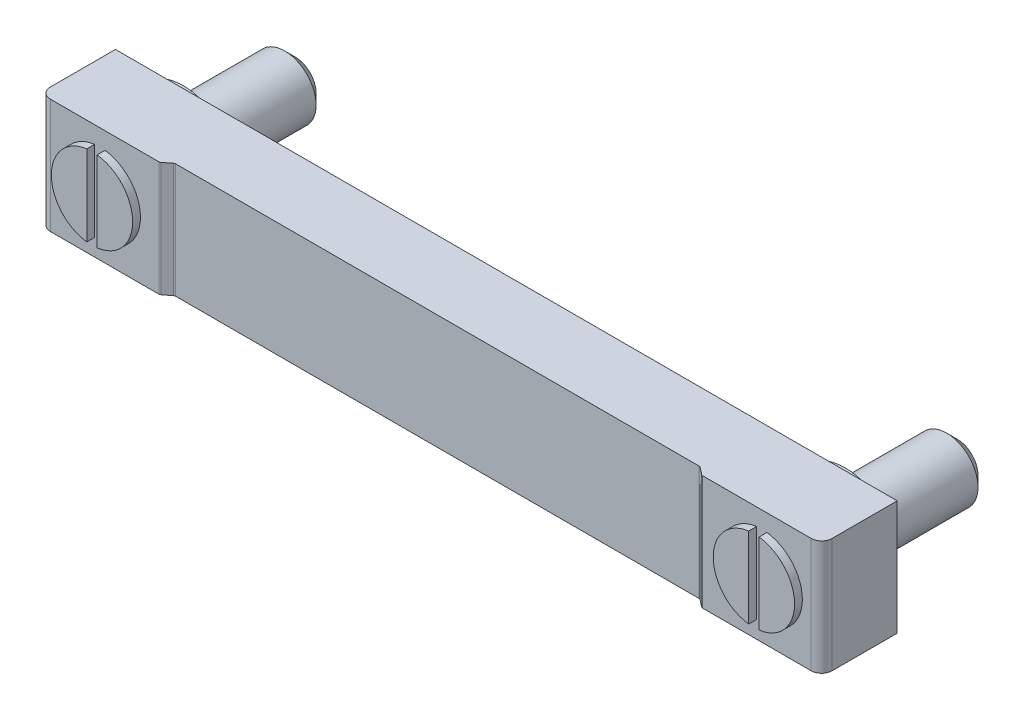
ISO-10303-21;
HEADER;
FILE_DESCRIPTION(('STEP AP214'),'2;1');
FILE_NAME('part.step','',(''),(''),'','','');
FILE_SCHEMA(('AUTOMOTIVE_DESIGN { 1 0 10303 214 1 1 1 1 }'));
ENDSEC;
DATA;
#1=APPLICATION_CONTEXT('core data for automotive mechanical design processes');
#2=APPLICATION_PROTOCOL_DEFINITION('international standard','automotive_design',2000,#1);
#3=PRODUCT_CONTEXT('',#1,'mechanical');
#4=PRODUCT('Part','Part','',(#3));
#5=PRODUCT_RELATED_PRODUCT_CATEGORY('part','',(#4));
#6=PRODUCT_DEFINITION_FORMATION('','',#4);
#7=PRODUCT_DEFINITION_CONTEXT('part definition',#1,'design');
#8=PRODUCT_DEFINITION('design','',#6,#7);
#9=PRODUCT_DEFINITION_SHAPE('','',#8);
#10=(LENGTH_UNIT() NAMED_UNIT(*) SI_UNIT(.MILLI.,.METRE.));
#11=(NAMED_UNIT(*) PLANE_ANGLE_UNIT() SI_UNIT($,.RADIAN.));
#12=(NAMED_UNIT(*) SI_UNIT($,.STERADIAN.) SOLID_ANGLE_UNIT());
#13=UNCERTAINTY_MEASURE_WITH_UNIT(LENGTH_MEASURE(1.E-05),#10,'distance_accuracy_value','');
#14=(GEOMETRIC_REPRESENTATION_CONTEXT(3) GLOBAL_UNCERTAINTY_ASSIGNED_CONTEXT((#13)) GLOBAL_UNIT_ASSIGNED_CONTEXT((#10,
#11,#12)) REPRESENTATION_CONTEXT('',''));
#15=CARTESIAN_POINT('',(0.,0.,0.));
#16=DIRECTION('',(0.,0.,1.));
#17=DIRECTION('',(1.,0.,0.));
#18=AXIS2_PLACEMENT_3D('',#15,#16,#17);
#19=CARTESIAN_POINT('',(10.,-11.,0.));
#20=DIRECTION('',(0.,0.,1.));
#21=DIRECTION('',(0.,1.,0.));
#22=AXIS2_PLACEMENT_3D('',#19,#20,#21);
#23=PLANE('',#22);
#24=CARTESIAN_POINT('',(127.,0.,0.));
#25=DIRECTION('',(0.,0.,1.));
#26=DIRECTION('',(0.,1.,0.));
#27=AXIS2_PLACEMENT_3D('',#24,#25,#26);
#28=CIRCLE('',#27,10.);
#29=CARTESIAN_POINT('',(127.,10.,0.));
#30=VERTEX_POINT('',#29);
#31=EDGE_CURVE('E197',#30,#30,#28,.T.);
#32=ORIENTED_EDGE('',*,*,#31,.F.);
#33=EDGE_LOOP('',(#32));
#34=FACE_BOUND('',#33,.T.);
#35=CARTESIAN_POINT('',(127.,0.,0.));
#36=DIRECTION('',(0.,0.,1.));
#37=DIRECTION('',(0.,1.,0.));
#38=AXIS2_PLACEMENT_3D('',#35,#36,#37);
#39=CIRCLE('',#38,6.);
#40=CARTESIAN_POINT('',(127.,6.,0.));
#41=VERTEX_POINT('',#40);
#42=EDGE_CURVE('E354',#41,#41,#39,.F.);
#43=ORIENTED_EDGE('',*,*,#42,.F.);
#44=EDGE_LOOP('',(#43));
#45=FACE_BOUND('',#44,.T.);
#46=ADVANCED_FACE('F14',(#34,#45),#23,.F.);
#47=CARTESIAN_POINT('',(115.671924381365,-11.,15.9974236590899));
#48=DIRECTION('',(0.,0.,-1.));
#49=DIRECTION('',(0.,-1.,0.));
#50=AXIS2_PLACEMENT_3D('',#47,#48,#49);
#51=PLANE('',#50);
#52=CARTESIAN_POINT('',(127.,0.,15.9974236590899));
#53=DIRECTION('',(0.,0.,1.));
#54=DIRECTION('',(0.,1.,0.));
#55=AXIS2_PLACEMENT_3D('',#52,#53,#54);
#56=CIRCLE('',#55,7.8);
#57=CARTESIAN_POINT('',(126.,7.73563184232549,15.9974236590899));
#58=VERTEX_POINT('',#57);
#59=CARTESIAN_POINT('',(126.,-7.73563184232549,15.9974236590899));
#60=VERTEX_POINT('',#59);
#61=EDGE_CURVE('E179',#58,#60,#56,.T.);
#62=ORIENTED_EDGE('',*,*,#61,.F.);
#63=DIRECTION('',(0.,1.,0.));
#64=VECTOR('',#63,1.);
#65=CARTESIAN_POINT('',(126.,-7.73563184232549,15.9974236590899));
#66=LINE('',#65,#64);
#67=EDGE_CURVE('E35',#60,#58,#66,.T.);
#68=ORIENTED_EDGE('',*,*,#67,.F.);
#69=EDGE_LOOP('',(#62,#68));
#70=FACE_BOUND('',#69,.T.);
#71=DIRECTION('',(-1.,0.,0.));
#72=VECTOR('',#71,1.);
#73=CARTESIAN_POINT('',(115.671924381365,11.,15.9974236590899));
#74=LINE('',#73,#72);
#75=CARTESIAN_POINT('',(136.5,11.,15.9974236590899));
#76=VERTEX_POINT('',#75);
#77=CARTESIAN_POINT('',(115.671924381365,11.,15.9974236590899));
#78=VERTEX_POINT('',#77);
#79=EDGE_CURVE('E253',#76,#78,#74,.T.);
#80=ORIENTED_EDGE('',*,*,#79,.T.);
#81=DIRECTION('',(0.,1.,0.));
#82=VECTOR('',#81,1.);
#83=CARTESIAN_POINT('',(115.671924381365,-11.,15.9974236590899));
#84=LINE('',#83,#82);
#85=CARTESIAN_POINT('',(115.671924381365,-11.,15.9974236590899));
#86=VERTEX_POINT('',#85);
#87=EDGE_CURVE('E324',#86,#78,#84,.T.);
#88=ORIENTED_EDGE('',*,*,#87,.F.);
#89=DIRECTION('',(-1.,0.,0.));
#90=VECTOR('',#89,1.);
#91=CARTESIAN_POINT('',(136.5,-11.,15.9974236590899));
#92=LINE('',#91,#90);
#93=CARTESIAN_POINT('',(136.5,-11.,15.9974236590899));
#94=VERTEX_POINT('',#93);
#95=EDGE_CURVE('E282',#94,#86,#92,.T.);
#96=ORIENTED_EDGE('',*,*,#95,.F.);
#97=DIRECTION('',(0.,1.,0.));
#98=VECTOR('',#97,1.);
#99=CARTESIAN_POINT('',(136.5,-11.,15.9974236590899));
#100=LINE('',#99,#98);
#101=EDGE_CURVE('E327',#94,#76,#100,.T.);
#102=ORIENTED_EDGE('',*,*,#101,.T.);
#103=EDGE_LOOP('',(#80,#88,#96,#102));
#104=FACE_BOUND('',#103,.T.);
#105=CARTESIAN_POINT('',(127.,0.,15.9974236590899));
#106=DIRECTION('',(0.,0.,1.));
#107=DIRECTION('',(0.,1.,0.));
#108=AXIS2_PLACEMENT_3D('',#105,#106,#107);
#109=CIRCLE('',#108,7.8);
#110=CARTESIAN_POINT('',(128.,-7.73563184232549,15.9974236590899));
#111=VERTEX_POINT('',#110);
#112=CARTESIAN_POINT('',(128.,7.73563184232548,15.9974236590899));
#113=VERTEX_POINT('',#112);
#114=EDGE_CURVE('E161',#111,#113,#109,.T.);
#115=ORIENTED_EDGE('',*,*,#114,.F.);
#116=DIRECTION('',(0.,-1.,0.));
#117=VECTOR('',#116,1.);
#118=CARTESIAN_POINT('',(128.,-7.73563184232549,15.9974236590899));
#119=LINE('',#118,#117);
#120=EDGE_CURVE('E28',#113,#111,#119,.T.);
#121=ORIENTED_EDGE('',*,*,#120,.F.);
#122=EDGE_LOOP('',(#115,#121));
#123=FACE_BOUND('',#122,.T.);
#124=ADVANCED_FACE('F162',(#70,#104,#123),#51,.F.);
#125=CARTESIAN_POINT('',(10.,-11.,0.));
#126=DIRECTION('',(0.,0.,1.));
#127=DIRECTION('',(0.,1.,0.));
#128=AXIS2_PLACEMENT_3D('',#125,#126,#127);
#129=PLANE('',#128);
#130=CARTESIAN_POINT('',(0.,0.,0.));
#131=DIRECTION('',(0.,0.,-1.));
#132=DIRECTION('',(0.,-1.,0.));
#133=AXIS2_PLACEMENT_3D('',#130,#131,#132);
#134=CIRCLE('',#133,10.);
#135=CARTESIAN_POINT('',(0.,-10.,0.));
#136=VERTEX_POINT('',#135);
#137=EDGE_CURVE('E200',#136,#136,#134,.T.);
#138=ORIENTED_EDGE('',*,*,#137,.T.);
#139=EDGE_LOOP('',(#138));
#140=FACE_BOUND('',#139,.T.);
#141=CARTESIAN_POINT('',(0.,0.,0.));
#142=DIRECTION('',(0.,0.,1.));
#143=DIRECTION('',(0.,1.,0.));
#144=AXIS2_PLACEMENT_3D('',#141,#142,#143);
#145=CIRCLE('',#144,6.);
#146=CARTESIAN_POINT('',(0.,6.,0.));
#147=VERTEX_POINT('',#146);
#148=EDGE_CURVE('E345',#147,#147,#145,.F.);
#149=ORIENTED_EDGE('',*,*,#148,.F.);
#150=EDGE_LOOP('',(#149));
#151=FACE_BOUND('',#150,.T.);
#152=ADVANCED_FACE('F380',(#140,#151),#129,.F.);
#153=CARTESIAN_POINT('',(137.,-11.,1.49742365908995));
#154=DIRECTION('',(0.,0.,1.));
#155=DIRECTION('',(0.,1.,0.));
#156=AXIS2_PLACEMENT_3D('',#153,#154,#155);
#157=PLANE('',#156);
#158=DIRECTION('',(1.,0.,0.));
#159=VECTOR('',#158,1.);
#160=CARTESIAN_POINT('',(137.,11.,1.49742365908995));
#161=LINE('',#160,#159);
#162=CARTESIAN_POINT('',(-11.5,11.,1.49742365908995));
#163=VERTEX_POINT('',#162);
#164=CARTESIAN_POINT('',(138.5,11.,1.49742365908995));
#165=VERTEX_POINT('',#164);
#166=EDGE_CURVE('E246',#163,#165,#161,.T.);
#167=ORIENTED_EDGE('',*,*,#166,.T.);
#168=DIRECTION('',(0.,1.,0.));
#169=VECTOR('',#168,1.);
#170=CARTESIAN_POINT('',(138.5,-11.,1.49742365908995));
#171=LINE('',#170,#169);
#172=CARTESIAN_POINT('',(138.5,-11.,1.49742365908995));
#173=VERTEX_POINT('',#172);
#174=EDGE_CURVE('E333',#173,#165,#171,.T.);
#175=ORIENTED_EDGE('',*,*,#174,.F.);
#176=DIRECTION('',(1.,0.,0.));
#177=VECTOR('',#176,1.);
#178=CARTESIAN_POINT('',(-11.5,-11.,1.49742365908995));
#179=LINE('',#178,#177);
#180=CARTESIAN_POINT('',(-11.5,-11.,1.49742365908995));
#181=VERTEX_POINT('',#180);
#182=EDGE_CURVE('E276',#181,#173,#179,.T.);
#183=ORIENTED_EDGE('',*,*,#182,.F.);
#184=DIRECTION('',(0.,1.,0.));
#185=VECTOR('',#184,1.);
#186=CARTESIAN_POINT('',(-11.5,-11.,1.49742365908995));
#187=LINE('',#186,#185);
#188=EDGE_CURVE('E336',#181,#163,#187,.T.);
#189=ORIENTED_EDGE('',*,*,#188,.T.);
#190=EDGE_LOOP('',(#167,#175,#183,#189));
#191=FACE_BOUND('',#190,.T.);
#192=CARTESIAN_POINT('',(0.,0.,1.49742365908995));
#193=DIRECTION('',(0.,0.,1.));
#194=DIRECTION('',(0.,1.,0.));
#195=AXIS2_PLACEMENT_3D('',#192,#193,#194);
#196=CIRCLE('',#195,10.);
#197=CARTESIAN_POINT('',(0.,10.,1.49742365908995));
#198=VERTEX_POINT('',#197);
#199=EDGE_CURVE('E203',#198,#198,#196,.F.);
#200=ORIENTED_EDGE('',*,*,#199,.F.);
#201=EDGE_LOOP('',(#200));
#202=FACE_BOUND('',#201,.T.);
#203=CARTESIAN_POINT('',(127.,0.,1.49742365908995));
#204=DIRECTION('',(0.,0.,1.));
#205=DIRECTION('',(0.,1.,0.));
#206=AXIS2_PLACEMENT_3D('',#203,#204,#205);
#207=CIRCLE('',#206,10.);
#208=CARTESIAN_POINT('',(127.,10.,1.49742365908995));
#209=VERTEX_POINT('',#208);
#210=EDGE_CURVE('E342',#209,#209,#207,.F.);
#211=ORIENTED_EDGE('',*,*,#210,.F.);
#212=EDGE_LOOP('',(#211));
#213=FACE_BOUND('',#212,.T.);
#214=ADVANCED_FACE('F432',(#191,#202,#213),#157,.F.);
#215=CARTESIAN_POINT('',(11.3280756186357,-11.,15.9974236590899));
#216=DIRECTION('',(0.,0.,-1.));
#217=DIRECTION('',(0.,-1.,0.));
#218=AXIS2_PLACEMENT_3D('',#215,#216,#217);
#219=PLANE('',#218);
#220=CARTESIAN_POINT('',(0.,0.,15.9974236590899));
#221=DIRECTION('',(0.,0.,1.));
#222=DIRECTION('',(0.,1.,0.));
#223=AXIS2_PLACEMENT_3D('',#220,#221,#222);
#224=CIRCLE('',#223,7.8);
#225=CARTESIAN_POINT('',(-1.,7.73563184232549,15.9974236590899));
#226=VERTEX_POINT('',#225);
#227=CARTESIAN_POINT('',(-1.,-7.73563184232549,15.9974236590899));
#228=VERTEX_POINT('',#227);
#229=EDGE_CURVE('E223',#226,#228,#224,.T.);
#230=ORIENTED_EDGE('',*,*,#229,.F.);
#231=DIRECTION('',(0.,1.,0.));
#232=VECTOR('',#231,1.);
#233=CARTESIAN_POINT('',(-1.,-7.73563184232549,15.9974236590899));
#234=LINE('',#233,#232);
#235=EDGE_CURVE('E226',#228,#226,#234,.T.);
#236=ORIENTED_EDGE('',*,*,#235,.F.);
#237=EDGE_LOOP('',(#230,#236));
#238=FACE_BOUND('',#237,.T.);
#239=DIRECTION('',(-1.,0.,0.));
#240=VECTOR('',#239,1.);
#241=CARTESIAN_POINT('',(11.3280756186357,11.,15.9974236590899));
#242=LINE('',#241,#240);
#243=CARTESIAN_POINT('',(11.3280756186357,11.,15.9974236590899));
#244=VERTEX_POINT('',#243);
#245=CARTESIAN_POINT('',(-9.5,11.,15.9974236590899));
#246=VERTEX_POINT('',#245);
#247=EDGE_CURVE('E269',#244,#246,#242,.T.);
#248=ORIENTED_EDGE('',*,*,#247,.T.);
#249=DIRECTION('',(0.,1.,0.));
#250=VECTOR('',#249,1.);
#251=CARTESIAN_POINT('',(-9.5,-11.,15.9974236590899));
#252=LINE('',#251,#250);
#253=CARTESIAN_POINT('',(-9.5,-11.,15.9974236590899));
#254=VERTEX_POINT('',#253);
#255=EDGE_CURVE('E300',#254,#246,#252,.T.);
#256=ORIENTED_EDGE('',*,*,#255,.F.);
#257=DIRECTION('',(-1.,0.,0.));
#258=VECTOR('',#257,1.);
#259=CARTESIAN_POINT('',(11.3280756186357,-11.,15.9974236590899));
#260=LINE('',#259,#258);
#261=CARTESIAN_POINT('',(11.3280756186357,-11.,15.9974236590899));
#262=VERTEX_POINT('',#261);
#263=EDGE_CURVE('E298',#262,#254,#260,.T.);
#264=ORIENTED_EDGE('',*,*,#263,.F.);
#265=DIRECTION('',(0.,1.,0.));
#266=VECTOR('',#265,1.);
#267=CARTESIAN_POINT('',(11.3280756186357,-11.,15.9974236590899));
#268=LINE('',#267,#266);
#269=EDGE_CURVE('E303',#262,#244,#268,.T.);
#270=ORIENTED_EDGE('',*,*,#269,.T.);
#271=EDGE_LOOP('',(#248,#256,#264,#270));
#272=FACE_BOUND('',#271,.T.);
#273=CARTESIAN_POINT('',(0.,0.,15.9974236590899));
#274=DIRECTION('',(0.,0.,1.));
#275=DIRECTION('',(0.,1.,0.));
#276=AXIS2_PLACEMENT_3D('',#273,#274,#275);
#277=CIRCLE('',#276,7.8);
#278=CARTESIAN_POINT('',(1.,-7.73563184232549,15.9974236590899));
#279=VERTEX_POINT('',#278);
#280=CARTESIAN_POINT('',(1.,7.73563184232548,15.9974236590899));
#281=VERTEX_POINT('',#280);
#282=EDGE_CURVE('E206',#279,#281,#277,.T.);
#283=ORIENTED_EDGE('',*,*,#282,.F.);
#284=DIRECTION('',(0.,-1.,0.));
#285=VECTOR('',#284,1.);
#286=CARTESIAN_POINT('',(1.,-7.73563184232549,15.9974236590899));
#287=LINE('',#286,#285);
#288=EDGE_CURVE('E209',#281,#279,#287,.T.);
#289=ORIENTED_EDGE('',*,*,#288,.F.);
#290=EDGE_LOOP('',(#283,#289));
#291=FACE_BOUND('',#290,.T.);
#292=ADVANCED_FACE('F429',(#238,#272,#291),#219,.F.);
#293=CARTESIAN_POINT('',(-9.5,-11.,13.9974236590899));
#294=DIRECTION('',(0.,1.,0.));
#295=DIRECTION('',(0.,0.,-1.));
#296=AXIS2_PLACEMENT_3D('',#293,#294,#295);
#297=CYLINDRICAL_SURFACE('',#296,2.);
#298=CARTESIAN_POINT('',(-9.5,11.,13.9974236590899));
#299=DIRECTION('',(0.,-1.,0.));
#300=DIRECTION('',(0.,0.,-1.));
#301=AXIS2_PLACEMENT_3D('',#298,#299,#300);
#302=CIRCLE('',#301,2.);
#303=CARTESIAN_POINT('',(-11.5,11.,13.9974236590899));
#304=VERTEX_POINT('',#303);
#305=EDGE_CURVE('E240',#246,#304,#302,.T.);
#306=ORIENTED_EDGE('',*,*,#305,.T.);
#307=DIRECTION('',(0.,1.,0.));
#308=VECTOR('',#307,1.);
#309=CARTESIAN_POINT('',(-11.5,-11.,13.9974236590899));
#310=LINE('',#309,#308);
#311=CARTESIAN_POINT('',(-11.5,-11.,13.9974236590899));
#312=VERTEX_POINT('',#311);
#313=EDGE_CURVE('E339',#312,#304,#310,.T.);
#314=ORIENTED_EDGE('',*,*,#313,.F.);
#315=CARTESIAN_POINT('',(-9.5,-11.,13.9974236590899));
#316=DIRECTION('',(0.,-1.,0.));
#317=DIRECTION('',(0.,0.,-1.));
#318=AXIS2_PLACEMENT_3D('',#315,#316,#317);
#319=CIRCLE('',#318,2.);
#320=EDGE_CURVE('E271',#254,#312,#319,.T.);
#321=ORIENTED_EDGE('',*,*,#320,.F.);
#322=ORIENTED_EDGE('',*,*,#255,.T.);
#323=EDGE_LOOP('',(#306,#314,#321,#322));
#324=FACE_BOUND('',#323,.T.);
#325=ADVANCED_FACE('F16',(#324),#297,.T.);
#326=CARTESIAN_POINT('',(-11.5,-11.,1.49742365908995));
#327=DIRECTION('',(1.,0.,0.));
#328=DIRECTION('',(0.,1.,0.));
#329=AXIS2_PLACEMENT_3D('',#326,#327,#328);
#330=PLANE('',#329);
#331=DIRECTION('',(0.,0.,-1.));
#332=VECTOR('',#331,1.);
#333=CARTESIAN_POINT('',(-11.5,11.,1.49742365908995));
#334=LINE('',#333,#332);
#335=EDGE_CURVE('E243',#304,#163,#334,.T.);
#336=ORIENTED_EDGE('',*,*,#335,.T.);
#337=ORIENTED_EDGE('',*,*,#188,.F.);
#338=DIRECTION('',(0.,0.,-1.));
#339=VECTOR('',#338,1.);
#340=CARTESIAN_POINT('',(-11.5,-11.,1.49742365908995));
#341=LINE('',#340,#339);
#342=EDGE_CURVE('E274',#312,#181,#341,.T.);
#343=ORIENTED_EDGE('',*,*,#342,.F.);
#344=ORIENTED_EDGE('',*,*,#313,.T.);
#345=EDGE_LOOP('',(#336,#337,#343,#344));
#346=FACE_BOUND('',#345,.T.);
#347=ADVANCED_FACE('F468',(#346),#330,.F.);
#348=CARTESIAN_POINT('',(138.5,-11.,1.49742365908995));
#349=DIRECTION('',(-1.,0.,0.));
#350=DIRECTION('',(0.,-1.,0.));
#351=AXIS2_PLACEMENT_3D('',#348,#349,#350);
#352=PLANE('',#351);
#353=DIRECTION('',(0.,0.,1.));
#354=VECTOR('',#353,1.);
#355=CARTESIAN_POINT('',(138.5,11.,1.49742365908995));
#356=LINE('',#355,#354);
#357=CARTESIAN_POINT('',(138.5,11.,13.9974236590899));
#358=VERTEX_POINT('',#357);
#359=EDGE_CURVE('E248',#165,#358,#356,.T.);
#360=ORIENTED_EDGE('',*,*,#359,.T.);
#361=DIRECTION('',(0.,1.,0.));
#362=VECTOR('',#361,1.);
#363=CARTESIAN_POINT('',(138.5,-11.,13.9974236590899));
#364=LINE('',#363,#362);
#365=CARTESIAN_POINT('',(138.5,-11.,13.9974236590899));
#366=VERTEX_POINT('',#365);
#367=EDGE_CURVE('E330',#366,#358,#364,.T.);
#368=ORIENTED_EDGE('',*,*,#367,.F.);
#369=DIRECTION('',(0.,0.,1.));
#370=VECTOR('',#369,1.);
#371=CARTESIAN_POINT('',(138.5,-11.,1.49742365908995));
#372=LINE('',#371,#370);
#373=EDGE_CURVE('E278',#173,#366,#372,.T.);
#374=ORIENTED_EDGE('',*,*,#373,.F.);
#375=ORIENTED_EDGE('',*,*,#174,.T.);
#376=EDGE_LOOP('',(#360,#368,#374,#375));
#377=FACE_BOUND('',#376,.T.);
#378=ADVANCED_FACE('F464',(#377),#352,.F.);
#379=CARTESIAN_POINT('',(136.5,-11.,13.9974236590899));
#380=DIRECTION('',(0.,1.,0.));
#381=DIRECTION('',(0.,0.,-1.));
#382=AXIS2_PLACEMENT_3D('',#379,#380,#381);
#383=CYLINDRICAL_SURFACE('',#382,2.);
#384=CARTESIAN_POINT('',(136.5,11.,13.9974236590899));
#385=DIRECTION('',(0.,-1.,0.));
#386=DIRECTION('',(0.,0.,-1.));
#387=AXIS2_PLACEMENT_3D('',#384,#385,#386);
#388=CIRCLE('',#387,2.);
#389=EDGE_CURVE('E250',#358,#76,#388,.T.);
#390=ORIENTED_EDGE('',*,*,#389,.T.);
#391=ORIENTED_EDGE('',*,*,#101,.F.);
#392=CARTESIAN_POINT('',(136.5,-11.,13.9974236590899));
#393=DIRECTION('',(0.,-1.,0.));
#394=DIRECTION('',(0.,0.,-1.));
#395=AXIS2_PLACEMENT_3D('',#392,#393,#394);
#396=CIRCLE('',#395,2.);
#397=EDGE_CURVE('E280',#366,#94,#396,.T.);
#398=ORIENTED_EDGE('',*,*,#397,.F.);
#399=ORIENTED_EDGE('',*,*,#367,.T.);
#400=EDGE_LOOP('',(#390,#391,#398,#399));
#401=FACE_BOUND('',#400,.T.);
#402=ADVANCED_FACE('F459',(#401),#383,.T.);
#403=CARTESIAN_POINT('',(115.671924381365,-11.,15.4974236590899));
#404=DIRECTION('',(0.,1.,0.));
#405=DIRECTION('',(0.,0.,-1.));
#406=AXIS2_PLACEMENT_3D('',#403,#404,#405);
#407=CYLINDRICAL_SURFACE('',#406,0.499999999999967);
#408=CARTESIAN_POINT('',(115.671924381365,11.,15.4974236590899));
#409=DIRECTION('',(0.,-1.,0.));
#410=DIRECTION('',(0.,0.,-1.));
#411=AXIS2_PLACEMENT_3D('',#408,#409,#410);
#412=CIRCLE('',#411,0.499999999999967);
#413=CARTESIAN_POINT('',(115.364431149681,11.,15.891692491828));
#414=VERTEX_POINT('',#413);
#415=EDGE_CURVE('E255',#78,#414,#412,.T.);
#416=ORIENTED_EDGE('',*,*,#415,.T.);
#417=DIRECTION('',(0.,1.,0.));
#418=VECTOR('',#417,1.);
#419=CARTESIAN_POINT('',(115.364431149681,-11.,15.891692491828));
#420=LINE('',#419,#418);
#421=CARTESIAN_POINT('',(115.364431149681,-11.,15.891692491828));
#422=VERTEX_POINT('',#421);
#423=EDGE_CURVE('E321',#422,#414,#420,.T.);
#424=ORIENTED_EDGE('',*,*,#423,.F.);
#425=CARTESIAN_POINT('',(115.671924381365,-11.,15.4974236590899));
#426=DIRECTION('',(0.,-1.,0.));
#427=DIRECTION('',(0.,0.,-1.));
#428=AXIS2_PLACEMENT_3D('',#425,#426,#427);
#429=CIRCLE('',#428,0.499999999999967);
#430=EDGE_CURVE('E284',#86,#422,#429,.T.);
#431=ORIENTED_EDGE('',*,*,#430,.F.);
#432=ORIENTED_EDGE('',*,*,#87,.T.);
#433=EDGE_LOOP('',(#416,#424,#431,#432));
#434=FACE_BOUND('',#433,.T.);
#435=ADVANCED_FACE('F456',(#434),#407,.T.);
#436=CARTESIAN_POINT('',(115.364431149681,-11.,15.891692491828));
#437=DIRECTION('',(0.61498646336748,0.,-0.788537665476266));
#438=DIRECTION('',(0.788537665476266,0.,0.61498646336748));
#439=AXIS2_PLACEMENT_3D('',#436,#437,#438);
#440=PLANE('',#439);
#441=DIRECTION('',(-0.788537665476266,0.,-0.61498646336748));
#442=VECTOR('',#441,1.);
#443=CARTESIAN_POINT('',(115.364431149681,11.,15.891692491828));
#444=LINE('',#443,#442);
#445=CARTESIAN_POINT('',(114.012389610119,11.,14.83722511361));
#446=VERTEX_POINT('',#445);
#447=EDGE_CURVE('E257',#414,#446,#444,.T.);
#448=ORIENTED_EDGE('',*,*,#447,.T.);
#449=DIRECTION('',(0.,1.,0.));
#450=VECTOR('',#449,1.);
#451=CARTESIAN_POINT('',(114.012389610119,-11.,14.83722511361));
#452=LINE('',#451,#450);
#453=CARTESIAN_POINT('',(114.012389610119,-11.,14.83722511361));
#454=VERTEX_POINT('',#453);
#455=EDGE_CURVE('E318',#454,#446,#452,.T.);
#456=ORIENTED_EDGE('',*,*,#455,.F.);
#457=DIRECTION('',(-0.788537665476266,0.,-0.61498646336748));
#458=VECTOR('',#457,1.);
#459=CARTESIAN_POINT('',(115.364431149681,-11.,15.891692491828));
#460=LINE('',#459,#458);
#461=EDGE_CURVE('E286',#422,#454,#460,.T.);
#462=ORIENTED_EDGE('',*,*,#461,.F.);
#463=ORIENTED_EDGE('',*,*,#423,.T.);
#464=EDGE_LOOP('',(#448,#456,#462,#463));
#465=FACE_BOUND('',#464,.T.);
#466=ADVANCED_FACE('F452',(#465),#440,.F.);
#467=CARTESIAN_POINT('',(113.704896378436,-11.,15.2314939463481));
#468=DIRECTION('',(0.,1.,0.));
#469=DIRECTION('',(0.,0.,-1.));
#470=AXIS2_PLACEMENT_3D('',#467,#468,#469);
#471=CYLINDRICAL_SURFACE('',#470,0.50000000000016);
#472=CARTESIAN_POINT('',(113.704896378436,11.,15.2314939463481));
#473=DIRECTION('',(0.,1.,0.));
#474=DIRECTION('',(0.,0.,-1.));
#475=AXIS2_PLACEMENT_3D('',#472,#473,#474);
#476=CIRCLE('',#475,0.50000000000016);
#477=CARTESIAN_POINT('',(113.704896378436,11.,14.7314939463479));
#478=VERTEX_POINT('',#477);
#479=EDGE_CURVE('E259',#446,#478,#476,.T.);
#480=ORIENTED_EDGE('',*,*,#479,.T.);
#481=DIRECTION('',(0.,1.,0.));
#482=VECTOR('',#481,1.);
#483=CARTESIAN_POINT('',(113.704896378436,-11.,14.7314939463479));
#484=LINE('',#483,#482);
#485=CARTESIAN_POINT('',(113.704896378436,-11.,14.7314939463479));
#486=VERTEX_POINT('',#485);
#487=EDGE_CURVE('E315',#486,#478,#484,.T.);
#488=ORIENTED_EDGE('',*,*,#487,.F.);
#489=CARTESIAN_POINT('',(113.704896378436,-11.,15.2314939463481));
#490=DIRECTION('',(0.,1.,0.));
#491=DIRECTION('',(0.,0.,-1.));
#492=AXIS2_PLACEMENT_3D('',#489,#490,#491);
#493=CIRCLE('',#492,0.50000000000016);
#494=EDGE_CURVE('E288',#454,#486,#493,.T.);
#495=ORIENTED_EDGE('',*,*,#494,.F.);
#496=ORIENTED_EDGE('',*,*,#455,.T.);
#497=EDGE_LOOP('',(#480,#488,#495,#496));
#498=FACE_BOUND('',#497,.T.);
#499=ADVANCED_FACE('F448',(#498),#471,.F.);
#500=CARTESIAN_POINT('',(113.704896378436,-11.,14.7314939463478));
#501=DIRECTION('',(0.,0.,-1.));
#502=DIRECTION('',(1.,0.,0.));
#503=AXIS2_PLACEMENT_3D('',#500,#501,#502);
#504=PLANE('',#503);
#505=DIRECTION('',(-1.,0.,0.));
#506=VECTOR('',#505,1.);
#507=CARTESIAN_POINT('',(113.704896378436,11.,14.7314939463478));
#508=LINE('',#507,#506);
#509=CARTESIAN_POINT('',(13.2951036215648,11.,14.7314939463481));
#510=VERTEX_POINT('',#509);
#511=EDGE_CURVE('E261',#478,#510,#508,.T.);
#512=ORIENTED_EDGE('',*,*,#511,.T.);
#513=DIRECTION('',(0.,1.,0.));
#514=VECTOR('',#513,1.);
#515=CARTESIAN_POINT('',(13.2951036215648,-11.,14.7314939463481));
#516=LINE('',#515,#514);
#517=CARTESIAN_POINT('',(13.2951036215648,-11.,14.7314939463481));
#518=VERTEX_POINT('',#517);
#519=EDGE_CURVE('E312',#518,#510,#516,.T.);
#520=ORIENTED_EDGE('',*,*,#519,.F.);
#521=DIRECTION('',(-1.,0.,0.));
#522=VECTOR('',#521,1.);
#523=CARTESIAN_POINT('',(113.704896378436,-11.,14.7314939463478));
#524=LINE('',#523,#522);
#525=EDGE_CURVE('E290',#486,#518,#524,.T.);
#526=ORIENTED_EDGE('',*,*,#525,.F.);
#527=ORIENTED_EDGE('',*,*,#487,.T.);
#528=EDGE_LOOP('',(#512,#520,#526,#527));
#529=FACE_BOUND('',#528,.T.);
#530=ADVANCED_FACE('F444',(#529),#504,.F.);
#531=CARTESIAN_POINT('',(13.2951036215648,-11.,15.2314939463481));
#532=DIRECTION('',(0.,1.,0.));
#533=DIRECTION('',(0.,0.,-1.));
#534=AXIS2_PLACEMENT_3D('',#531,#532,#533);
#535=CYLINDRICAL_SURFACE('',#534,0.500000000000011);
#536=CARTESIAN_POINT('',(13.2951036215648,11.,15.2314939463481));
#537=DIRECTION('',(0.,1.,0.));
#538=DIRECTION('',(0.,0.,-1.));
#539=AXIS2_PLACEMENT_3D('',#536,#537,#538);
#540=CIRCLE('',#539,0.500000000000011);
#541=CARTESIAN_POINT('',(12.987610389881,11.,14.83722511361));
#542=VERTEX_POINT('',#541);
#543=EDGE_CURVE('E263',#510,#542,#540,.T.);
#544=ORIENTED_EDGE('',*,*,#543,.T.);
#545=DIRECTION('',(0.,1.,0.));
#546=VECTOR('',#545,1.);
#547=CARTESIAN_POINT('',(12.987610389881,-11.,14.83722511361));
#548=LINE('',#547,#546);
#549=CARTESIAN_POINT('',(12.987610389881,-11.,14.83722511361));
#550=VERTEX_POINT('',#549);
#551=EDGE_CURVE('E309',#550,#542,#548,.T.);
#552=ORIENTED_EDGE('',*,*,#551,.F.);
#553=CARTESIAN_POINT('',(13.2951036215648,-11.,15.2314939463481));
#554=DIRECTION('',(0.,1.,0.));
#555=DIRECTION('',(0.,0.,-1.));
#556=AXIS2_PLACEMENT_3D('',#553,#554,#555);
#557=CIRCLE('',#556,0.500000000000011);
#558=EDGE_CURVE('E292',#518,#550,#557,.T.);
#559=ORIENTED_EDGE('',*,*,#558,.F.);
#560=ORIENTED_EDGE('',*,*,#519,.T.);
#561=EDGE_LOOP('',(#544,#552,#559,#560));
#562=FACE_BOUND('',#561,.T.);
#563=ADVANCED_FACE('F440',(#562),#535,.F.);
#564=CARTESIAN_POINT('',(11.6355688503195,-11.,15.891692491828));
#565=DIRECTION('',(-0.614986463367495,0.,-0.788537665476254));
#566=DIRECTION('',(0.788537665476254,0.,-0.614986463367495));
#567=AXIS2_PLACEMENT_3D('',#564,#565,#566);
#568=PLANE('',#567);
#569=DIRECTION('',(-0.788537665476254,0.,0.614986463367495));
#570=VECTOR('',#569,1.);
#571=CARTESIAN_POINT('',(11.6355688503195,11.,15.891692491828));
#572=LINE('',#571,#570);
#573=CARTESIAN_POINT('',(11.6355688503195,11.,15.891692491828));
#574=VERTEX_POINT('',#573);
#575=EDGE_CURVE('E265',#542,#574,#572,.T.);
#576=ORIENTED_EDGE('',*,*,#575,.T.);
#577=DIRECTION('',(0.,1.,0.));
#578=VECTOR('',#577,1.);
#579=CARTESIAN_POINT('',(11.6355688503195,-11.,15.891692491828));
#580=LINE('',#579,#578);
#581=CARTESIAN_POINT('',(11.6355688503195,-11.,15.891692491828));
#582=VERTEX_POINT('',#581);
#583=EDGE_CURVE('E306',#582,#574,#580,.T.);
#584=ORIENTED_EDGE('',*,*,#583,.F.);
#585=DIRECTION('',(-0.788537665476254,0.,0.614986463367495));
#586=VECTOR('',#585,1.);
#587=CARTESIAN_POINT('',(11.6355688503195,-11.,15.891692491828));
#588=LINE('',#587,#586);
#589=EDGE_CURVE('E294',#550,#582,#588,.T.);
#590=ORIENTED_EDGE('',*,*,#589,.F.);
#591=ORIENTED_EDGE('',*,*,#551,.T.);
#592=EDGE_LOOP('',(#576,#584,#590,#591));
#593=FACE_BOUND('',#592,.T.);
#594=ADVANCED_FACE('F436',(#593),#568,.F.);
#595=CARTESIAN_POINT('',(11.3280756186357,-11.,15.4974236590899));
#596=DIRECTION('',(0.,1.,0.));
#597=DIRECTION('',(0.,0.,-1.));
#598=AXIS2_PLACEMENT_3D('',#595,#596,#597);
#599=CYLINDRICAL_SURFACE('',#598,0.499999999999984);
#600=CARTESIAN_POINT('',(11.3280756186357,11.,15.4974236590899));
#601=DIRECTION('',(0.,-1.,0.));
#602=DIRECTION('',(0.,0.,-1.));
#603=AXIS2_PLACEMENT_3D('',#600,#601,#602);
#604=CIRCLE('',#603,0.499999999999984);
#605=EDGE_CURVE('E267',#574,#244,#604,.T.);
#606=ORIENTED_EDGE('',*,*,#605,.T.);
#607=ORIENTED_EDGE('',*,*,#269,.F.);
#608=CARTESIAN_POINT('',(11.3280756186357,-11.,15.4974236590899));
#609=DIRECTION('',(0.,-1.,0.));
#610=DIRECTION('',(0.,0.,-1.));
#611=AXIS2_PLACEMENT_3D('',#608,#609,#610);
#612=CIRCLE('',#611,0.499999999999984);
#613=EDGE_CURVE('E296',#582,#262,#612,.T.);
#614=ORIENTED_EDGE('',*,*,#613,.F.);
#615=ORIENTED_EDGE('',*,*,#583,.T.);
#616=EDGE_LOOP('',(#606,#607,#614,#615));
#617=FACE_BOUND('',#616,.T.);
#618=ADVANCED_FACE('F427',(#617),#599,.T.);
#619=CARTESIAN_POINT('',(-9.5,-11.,13.9974236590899));
#620=DIRECTION('',(0.,1.,0.));
#621=DIRECTION('',(0.,0.,-1.));
#622=AXIS2_PLACEMENT_3D('',#619,#620,#621);
#623=PLANE('',#622);
#624=ORIENTED_EDGE('',*,*,#182,.T.);
#625=ORIENTED_EDGE('',*,*,#373,.T.);
#626=ORIENTED_EDGE('',*,*,#397,.T.);
#627=ORIENTED_EDGE('',*,*,#95,.T.);
#628=ORIENTED_EDGE('',*,*,#430,.T.);
#629=ORIENTED_EDGE('',*,*,#461,.T.);
#630=ORIENTED_EDGE('',*,*,#494,.T.);
#631=ORIENTED_EDGE('',*,*,#525,.T.);
#632=ORIENTED_EDGE('',*,*,#558,.T.);
#633=ORIENTED_EDGE('',*,*,#589,.T.);
#634=ORIENTED_EDGE('',*,*,#613,.T.);
#635=ORIENTED_EDGE('',*,*,#263,.T.);
#636=ORIENTED_EDGE('',*,*,#320,.T.);
#637=ORIENTED_EDGE('',*,*,#342,.T.);
#638=EDGE_LOOP('',(#624,#625,#626,#627,#628,#629,#630,#631,#632,#633,#634,#635,#636,#637));
#639=FACE_BOUND('',#638,.T.);
#640=ADVANCED_FACE('F423',(#639),#623,.F.);
#641=CARTESIAN_POINT('',(-9.5,11.,13.9974236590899));
#642=DIRECTION('',(0.,1.,0.));
#643=DIRECTION('',(0.,0.,-1.));
#644=AXIS2_PLACEMENT_3D('',#641,#642,#643);
#645=PLANE('',#644);
#646=ORIENTED_EDGE('',*,*,#166,.F.);
#647=ORIENTED_EDGE('',*,*,#335,.F.);
#648=ORIENTED_EDGE('',*,*,#305,.F.);
#649=ORIENTED_EDGE('',*,*,#247,.F.);
#650=ORIENTED_EDGE('',*,*,#605,.F.);
#651=ORIENTED_EDGE('',*,*,#575,.F.);
#652=ORIENTED_EDGE('',*,*,#543,.F.);
#653=ORIENTED_EDGE('',*,*,#511,.F.);
#654=ORIENTED_EDGE('',*,*,#479,.F.);
#655=ORIENTED_EDGE('',*,*,#447,.F.);
#656=ORIENTED_EDGE('',*,*,#415,.F.);
#657=ORIENTED_EDGE('',*,*,#79,.F.);
#658=ORIENTED_EDGE('',*,*,#389,.F.);
#659=ORIENTED_EDGE('',*,*,#359,.F.);
#660=EDGE_LOOP('',(#646,#647,#648,#649,#650,#651,#652,#653,#654,#655,#656,#657,#658,#659));
#661=FACE_BOUND('',#660,.T.);
#662=ADVANCED_FACE('F419',(#661),#645,.T.);
#663=CARTESIAN_POINT('',(0.,0.,17.4974236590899));
#664=DIRECTION('',(0.,0.,-1.));
#665=DIRECTION('',(0.,-1.,0.));
#666=AXIS2_PLACEMENT_3D('',#663,#664,#665);
#667=CYLINDRICAL_SURFACE('',#666,7.8);
#668=ORIENTED_EDGE('',*,*,#229,.T.);
#669=DIRECTION('',(0.,0.,-1.));
#670=VECTOR('',#669,1.);
#671=CARTESIAN_POINT('',(-1.,-7.73563184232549,17.4974236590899));
#672=LINE('',#671,#670);
#673=CARTESIAN_POINT('',(-1.,-7.73563184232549,17.4974236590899));
#674=VERTEX_POINT('',#673);
#675=EDGE_CURVE('E237',#674,#228,#672,.T.);
#676=ORIENTED_EDGE('',*,*,#675,.F.);
#677=CARTESIAN_POINT('',(0.,0.,17.4974236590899));
#678=DIRECTION('',(0.,0.,1.));
#679=DIRECTION('',(0.,1.,0.));
#680=AXIS2_PLACEMENT_3D('',#677,#678,#679);
#681=CIRCLE('',#680,7.8);
#682=CARTESIAN_POINT('',(-1.,7.73563184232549,17.4974236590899));
#683=VERTEX_POINT('',#682);
#684=EDGE_CURVE('E229',#683,#674,#681,.T.);
#685=ORIENTED_EDGE('',*,*,#684,.F.);
#686=DIRECTION('',(0.,0.,-1.));
#687=VECTOR('',#686,1.);
#688=CARTESIAN_POINT('',(-1.,7.73563184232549,17.4974236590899));
#689=LINE('',#688,#687);
#690=EDGE_CURVE('E234',#683,#226,#689,.T.);
#691=ORIENTED_EDGE('',*,*,#690,.T.);
#692=EDGE_LOOP('',(#668,#676,#685,#691));
#693=FACE_BOUND('',#692,.T.);
#694=ADVANCED_FACE('F415',(#693),#667,.T.);
#695=CARTESIAN_POINT('',(-1.,-7.73563184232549,17.4974236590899));
#696=DIRECTION('',(-1.,0.,0.));
#697=DIRECTION('',(0.,-1.,0.));
#698=AXIS2_PLACEMENT_3D('',#695,#696,#697);
#699=PLANE('',#698);
#700=ORIENTED_EDGE('',*,*,#235,.T.);
#701=ORIENTED_EDGE('',*,*,#690,.F.);
#702=DIRECTION('',(0.,1.,0.));
#703=VECTOR('',#702,1.);
#704=CARTESIAN_POINT('',(-1.,-7.73563184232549,17.4974236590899));
#705=LINE('',#704,#703);
#706=EDGE_CURVE('E232',#674,#683,#705,.T.);
#707=ORIENTED_EDGE('',*,*,#706,.F.);
#708=ORIENTED_EDGE('',*,*,#675,.T.);
#709=EDGE_LOOP('',(#700,#701,#707,#708));
#710=FACE_BOUND('',#709,.T.);
#711=ADVANCED_FACE('F411',(#710),#699,.F.);
#712=CARTESIAN_POINT('',(0.,0.,17.4974236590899));
#713=DIRECTION('',(0.,0.,1.));
#714=DIRECTION('',(0.,1.,0.));
#715=AXIS2_PLACEMENT_3D('',#712,#713,#714);
#716=PLANE('',#715);
#717=ORIENTED_EDGE('',*,*,#684,.T.);
#718=ORIENTED_EDGE('',*,*,#706,.T.);
#719=EDGE_LOOP('',(#717,#718));
#720=FACE_BOUND('',#719,.T.);
#721=ADVANCED_FACE('F407',(#720),#716,.T.);
#722=CARTESIAN_POINT('',(0.,0.,17.4974236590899));
#723=DIRECTION('',(0.,0.,-1.));
#724=DIRECTION('',(0.,-1.,0.));
#725=AXIS2_PLACEMENT_3D('',#722,#723,#724);
#726=CYLINDRICAL_SURFACE('',#725,7.8);
#727=ORIENTED_EDGE('',*,*,#282,.T.);
#728=DIRECTION('',(0.,0.,-1.));
#729=VECTOR('',#728,1.);
#730=CARTESIAN_POINT('',(1.,7.73563184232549,17.4974236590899));
#731=LINE('',#730,#729);
#732=CARTESIAN_POINT('',(1.,7.73563184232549,17.4974236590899));
#733=VERTEX_POINT('',#732);
#734=EDGE_CURVE('E220',#733,#281,#731,.T.);
#735=ORIENTED_EDGE('',*,*,#734,.F.);
#736=CARTESIAN_POINT('',(0.,0.,17.4974236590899));
#737=DIRECTION('',(0.,0.,1.));
#738=DIRECTION('',(0.,1.,0.));
#739=AXIS2_PLACEMENT_3D('',#736,#737,#738);
#740=CIRCLE('',#739,7.8);
#741=CARTESIAN_POINT('',(1.,-7.73563184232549,17.4974236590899));
#742=VERTEX_POINT('',#741);
#743=EDGE_CURVE('E212',#742,#733,#740,.T.);
#744=ORIENTED_EDGE('',*,*,#743,.F.);
#745=DIRECTION('',(0.,0.,-1.));
#746=VECTOR('',#745,1.);
#747=CARTESIAN_POINT('',(1.,-7.73563184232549,17.4974236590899));
#748=LINE('',#747,#746);
#749=EDGE_CURVE('E217',#742,#279,#748,.T.);
#750=ORIENTED_EDGE('',*,*,#749,.T.);
#751=EDGE_LOOP('',(#727,#735,#744,#750));
#752=FACE_BOUND('',#751,.T.);
#753=ADVANCED_FACE('F403',(#752),#726,.T.);
#754=CARTESIAN_POINT('',(1.,-7.73563184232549,17.4974236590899));
#755=DIRECTION('',(1.,0.,0.));
#756=DIRECTION('',(0.,1.,0.));
#757=AXIS2_PLACEMENT_3D('',#754,#755,#756);
#758=PLANE('',#757);
#759=ORIENTED_EDGE('',*,*,#288,.T.);
#760=ORIENTED_EDGE('',*,*,#749,.F.);
#761=DIRECTION('',(0.,-1.,0.));
#762=VECTOR('',#761,1.);
#763=CARTESIAN_POINT('',(1.,-7.73563184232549,17.4974236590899));
#764=LINE('',#763,#762);
#765=EDGE_CURVE('E215',#733,#742,#764,.T.);
#766=ORIENTED_EDGE('',*,*,#765,.F.);
#767=ORIENTED_EDGE('',*,*,#734,.T.);
#768=EDGE_LOOP('',(#759,#760,#766,#767));
#769=FACE_BOUND('',#768,.T.);
#770=ADVANCED_FACE('F399',(#769),#758,.F.);
#771=CARTESIAN_POINT('',(0.,0.,17.4974236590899));
#772=DIRECTION('',(0.,0.,1.));
#773=DIRECTION('',(0.,1.,0.));
#774=AXIS2_PLACEMENT_3D('',#771,#772,#773);
#775=PLANE('',#774);
#776=ORIENTED_EDGE('',*,*,#743,.T.);
#777=ORIENTED_EDGE('',*,*,#765,.T.);
#778=EDGE_LOOP('',(#776,#777));
#779=FACE_BOUND('',#778,.T.);
#780=ADVANCED_FACE('F395',(#779),#775,.T.);
#781=CARTESIAN_POINT('',(0.,0.,29.7816949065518));
#782=DIRECTION('',(0.,0.,-1.));
#783=DIRECTION('',(0.,-1.,0.));
#784=AXIS2_PLACEMENT_3D('',#781,#782,#783);
#785=CYLINDRICAL_SURFACE('',#784,10.);
#786=ORIENTED_EDGE('',*,*,#137,.F.);
#787=EDGE_LOOP('',(#786));
#788=FACE_BOUND('',#787,.T.);
#789=ORIENTED_EDGE('',*,*,#199,.T.);
#790=EDGE_LOOP('',(#789));
#791=FACE_BOUND('',#790,.T.);
#792=ADVANCED_FACE('F391',(#788,#791),#785,.T.);
#793=CARTESIAN_POINT('',(127.,0.,-28.2842712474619));
#794=DIRECTION('',(0.,0.,1.));
#795=DIRECTION('',(0.,1.,0.));
#796=AXIS2_PLACEMENT_3D('',#793,#794,#795);
#797=CYLINDRICAL_SURFACE('',#796,10.);
#798=ORIENTED_EDGE('',*,*,#31,.T.);
#799=EDGE_LOOP('',(#798));
#800=FACE_BOUND('',#799,.T.);
#801=ORIENTED_EDGE('',*,*,#210,.T.);
#802=EDGE_LOOP('',(#801));
#803=FACE_BOUND('',#802,.T.);
#804=ADVANCED_FACE('F388',(#800,#803),#797,.T.);
#805=CARTESIAN_POINT('',(0.,0.,-21.5));
#806=DIRECTION('',(0.,0.,1.));
#807=DIRECTION('',(0.,1.,0.));
#808=AXIS2_PLACEMENT_3D('',#805,#806,#807);
#809=CYLINDRICAL_SURFACE('',#808,6.);
#810=CARTESIAN_POINT('',(0.,0.,-19.5));
#811=DIRECTION('',(0.,0.,-1.));
#812=DIRECTION('',(0.,-1.,0.));
#813=AXIS2_PLACEMENT_3D('',#810,#811,#812);
#814=CIRCLE('',#813,6.);
#815=CARTESIAN_POINT('',(0.,-6.,-19.5));
#816=VERTEX_POINT('',#815);
#817=EDGE_CURVE('E351',#816,#816,#814,.F.);
#818=ORIENTED_EDGE('',*,*,#817,.T.);
#819=EDGE_LOOP('',(#818));
#820=FACE_BOUND('',#819,.T.);
#821=ORIENTED_EDGE('',*,*,#148,.T.);
#822=EDGE_LOOP('',(#821));
#823=FACE_BOUND('',#822,.T.);
#824=ADVANCED_FACE('F386',(#820,#823),#809,.T.);
#825=CARTESIAN_POINT('',(0.,0.,-21.5));
#826=DIRECTION('',(0.,0.,-1.));
#827=DIRECTION('',(0.,-1.,0.));
#828=AXIS2_PLACEMENT_3D('',#825,#826,#827);
#829=PLANE('',#828);
#830=CARTESIAN_POINT('',(0.,0.,-21.5));
#831=DIRECTION('',(0.,0.,-1.));
#832=DIRECTION('',(0.,-1.,0.));
#833=AXIS2_PLACEMENT_3D('',#830,#831,#832);
#834=CIRCLE('',#833,4.);
#835=CARTESIAN_POINT('',(0.,-4.,-21.5));
#836=VERTEX_POINT('',#835);
#837=EDGE_CURVE('E348',#836,#836,#834,.T.);
#838=ORIENTED_EDGE('',*,*,#837,.T.);
#839=EDGE_LOOP('',(#838));
#840=FACE_BOUND('',#839,.T.);
#841=ADVANCED_FACE('F695',(#840),#829,.T.);
#842=CARTESIAN_POINT('',(0.,0.,-21.5));
#843=DIRECTION('',(0.,0.,1.));
#844=DIRECTION('',(0.,1.,0.));
#845=AXIS2_PLACEMENT_3D('',#842,#843,#844);
#846=CONICAL_SURFACE('',#845,4.,0.785398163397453);
#847=ORIENTED_EDGE('',*,*,#817,.F.);
#848=EDGE_LOOP('',(#847));
#849=FACE_BOUND('',#848,.T.);
#850=ORIENTED_EDGE('',*,*,#837,.F.);
#851=EDGE_LOOP('',(#850));
#852=FACE_BOUND('',#851,.T.);
#853=ADVANCED_FACE('F702',(#849,#852),#846,.T.);
#854=CARTESIAN_POINT('',(127.,0.,17.4974236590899));
#855=DIRECTION('',(0.,0.,-1.));
#856=DIRECTION('',(0.,-1.,0.));
#857=AXIS2_PLACEMENT_3D('',#854,#855,#856);
#858=CYLINDRICAL_SURFACE('',#857,7.8);
#859=ORIENTED_EDGE('',*,*,#61,.T.);
#860=DIRECTION('',(0.,0.,-1.));
#861=VECTOR('',#860,1.);
#862=CARTESIAN_POINT('',(126.,-7.73563184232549,17.4974236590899));
#863=LINE('',#862,#861);
#864=CARTESIAN_POINT('',(126.,-7.73563184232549,17.4974236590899));
#865=VERTEX_POINT('',#864);
#866=EDGE_CURVE('E195',#865,#60,#863,.T.);
#867=ORIENTED_EDGE('',*,*,#866,.F.);
#868=CARTESIAN_POINT('',(127.,0.,17.4974236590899));
#869=DIRECTION('',(0.,0.,1.));
#870=DIRECTION('',(0.,1.,0.));
#871=AXIS2_PLACEMENT_3D('',#868,#869,#870);
#872=CIRCLE('',#871,7.8);
#873=CARTESIAN_POINT('',(126.,7.73563184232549,17.4974236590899));
#874=VERTEX_POINT('',#873);
#875=EDGE_CURVE('E187',#874,#865,#872,.T.);
#876=ORIENTED_EDGE('',*,*,#875,.F.);
#877=DIRECTION('',(0.,0.,-1.));
#878=VECTOR('',#877,1.);
#879=CARTESIAN_POINT('',(126.,7.73563184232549,17.4974236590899));
#880=LINE('',#879,#878);
#881=EDGE_CURVE('E192',#874,#58,#880,.T.);
#882=ORIENTED_EDGE('',*,*,#881,.T.);
#883=EDGE_LOOP('',(#859,#867,#876,#882));
#884=FACE_BOUND('',#883,.T.);
#885=ADVANCED_FACE('F710',(#884),#858,.T.);
#886=CARTESIAN_POINT('',(126.,-7.73563184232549,17.4974236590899));
#887=DIRECTION('',(-1.,0.,0.));
#888=DIRECTION('',(0.,-1.,0.));
#889=AXIS2_PLACEMENT_3D('',#886,#887,#888);
#890=PLANE('',#889);
#891=ORIENTED_EDGE('',*,*,#67,.T.);
#892=ORIENTED_EDGE('',*,*,#881,.F.);
#893=DIRECTION('',(0.,1.,0.));
#894=VECTOR('',#893,1.);
#895=CARTESIAN_POINT('',(126.,-7.73563184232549,17.4974236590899));
#896=LINE('',#895,#894);
#897=EDGE_CURVE('E190',#865,#874,#896,.T.);
#898=ORIENTED_EDGE('',*,*,#897,.F.);
#899=ORIENTED_EDGE('',*,*,#866,.T.);
#900=EDGE_LOOP('',(#891,#892,#898,#899));
#901=FACE_BOUND('',#900,.T.);
#902=ADVANCED_FACE('F719',(#901),#890,.F.);
#903=CARTESIAN_POINT('',(127.,0.,17.4974236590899));
#904=DIRECTION('',(0.,0.,1.));
#905=DIRECTION('',(0.,1.,0.));
#906=AXIS2_PLACEMENT_3D('',#903,#904,#905);
#907=PLANE('',#906);
#908=ORIENTED_EDGE('',*,*,#875,.T.);
#909=ORIENTED_EDGE('',*,*,#897,.T.);
#910=EDGE_LOOP('',(#908,#909));
#911=FACE_BOUND('',#910,.T.);
#912=ADVANCED_FACE('F728',(#911),#907,.T.);
#913=CARTESIAN_POINT('',(127.,0.,17.4974236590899));
#914=DIRECTION('',(0.,0.,-1.));
#915=DIRECTION('',(0.,-1.,0.));
#916=AXIS2_PLACEMENT_3D('',#913,#914,#915);
#917=CYLINDRICAL_SURFACE('',#916,7.8);
#918=ORIENTED_EDGE('',*,*,#114,.T.);
#919=DIRECTION('',(0.,0.,-1.));
#920=VECTOR('',#919,1.);
#921=CARTESIAN_POINT('',(128.,7.73563184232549,17.4974236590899));
#922=LINE('',#921,#920);
#923=CARTESIAN_POINT('',(128.,7.73563184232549,17.4974236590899));
#924=VERTEX_POINT('',#923);
#925=EDGE_CURVE('E172',#924,#113,#922,.T.);
#926=ORIENTED_EDGE('',*,*,#925,.F.);
#927=CARTESIAN_POINT('',(127.,0.,17.4974236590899));
#928=DIRECTION('',(0.,0.,1.));
#929=DIRECTION('',(0.,1.,0.));
#930=AXIS2_PLACEMENT_3D('',#927,#928,#929);
#931=CIRCLE('',#930,7.8);
#932=CARTESIAN_POINT('',(128.,-7.73563184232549,17.4974236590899));
#933=VERTEX_POINT('',#932);
#934=EDGE_CURVE('E173',#933,#924,#931,.T.);
#935=ORIENTED_EDGE('',*,*,#934,.F.);
#936=DIRECTION('',(0.,0.,-1.));
#937=VECTOR('',#936,1.);
#938=CARTESIAN_POINT('',(128.,-7.73563184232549,17.4974236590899));
#939=LINE('',#938,#937);
#940=EDGE_CURVE('E170',#933,#111,#939,.T.);
#941=ORIENTED_EDGE('',*,*,#940,.T.);
#942=EDGE_LOOP('',(#918,#926,#935,#941));
#943=FACE_BOUND('',#942,.T.);
#944=ADVANCED_FACE('F175',(#943),#917,.T.);
#945=CARTESIAN_POINT('',(128.,-7.73563184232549,17.4974236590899));
#946=DIRECTION('',(1.,0.,0.));
#947=DIRECTION('',(0.,1.,0.));
#948=AXIS2_PLACEMENT_3D('',#945,#946,#947);
#949=PLANE('',#948);
#950=ORIENTED_EDGE('',*,*,#120,.T.);
#951=ORIENTED_EDGE('',*,*,#940,.F.);
#952=DIRECTION('',(0.,-1.,0.));
#953=VECTOR('',#952,1.);
#954=CARTESIAN_POINT('',(128.,-7.73563184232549,17.4974236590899));
#955=LINE('',#954,#953);
#956=EDGE_CURVE('E177',#924,#933,#955,.T.);
#957=ORIENTED_EDGE('',*,*,#956,.F.);
#958=ORIENTED_EDGE('',*,*,#925,.T.);
#959=EDGE_LOOP('',(#950,#951,#957,#958));
#960=FACE_BOUND('',#959,.T.);
#961=ADVANCED_FACE('F169',(#960),#949,.F.);
#962=CARTESIAN_POINT('',(127.,0.,17.4974236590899));
#963=DIRECTION('',(0.,0.,1.));
#964=DIRECTION('',(0.,1.,0.));
#965=AXIS2_PLACEMENT_3D('',#962,#963,#964);
#966=PLANE('',#965);
#967=ORIENTED_EDGE('',*,*,#934,.T.);
#968=ORIENTED_EDGE('',*,*,#956,.T.);
#969=EDGE_LOOP('',(#967,#968));
#970=FACE_BOUND('',#969,.T.);
#971=ADVANCED_FACE('F752',(#970),#966,.T.);
#972=CARTESIAN_POINT('',(127.,0.,-21.5));
#973=DIRECTION('',(0.,0.,1.));
#974=DIRECTION('',(0.,1.,0.));
#975=AXIS2_PLACEMENT_3D('',#972,#973,#974);
#976=CYLINDRICAL_SURFACE('',#975,6.);
#977=CARTESIAN_POINT('',(127.,0.,-19.5));
#978=DIRECTION('',(0.,0.,-1.));
#979=DIRECTION('',(0.,-1.,0.));
#980=AXIS2_PLACEMENT_3D('',#977,#978,#979);
#981=CIRCLE('',#980,6.);
#982=CARTESIAN_POINT('',(127.,-6.,-19.5));
#983=VERTEX_POINT('',#982);
#984=EDGE_CURVE('E9',#983,#983,#981,.F.);
#985=ORIENTED_EDGE('',*,*,#984,.T.);
#986=EDGE_LOOP('',(#985));
#987=FACE_BOUND('',#986,.T.);
#988=ORIENTED_EDGE('',*,*,#42,.T.);
#989=EDGE_LOOP('',(#988));
#990=FACE_BOUND('',#989,.T.);
#991=ADVANCED_FACE('F370',(#987,#990),#976,.T.);
#992=CARTESIAN_POINT('',(127.,0.,-21.5));
#993=DIRECTION('',(0.,0.,-1.));
#994=DIRECTION('',(0.,-1.,0.));
#995=AXIS2_PLACEMENT_3D('',#992,#993,#994);
#996=PLANE('',#995);
#997=CARTESIAN_POINT('',(127.,0.,-21.5));
#998=DIRECTION('',(0.,0.,-1.));
#999=DIRECTION('',(0.,-1.,0.));
#1000=AXIS2_PLACEMENT_3D('',#997,#998,#999);
#1001=CIRCLE('',#1000,4.);
#1002=CARTESIAN_POINT('',(127.,-4.,-21.5));
#1003=VERTEX_POINT('',#1002);
#1004=EDGE_CURVE('E22',#1003,#1003,#1001,.T.);
#1005=ORIENTED_EDGE('',*,*,#1004,.T.);
#1006=EDGE_LOOP('',(#1005));
#1007=FACE_BOUND('',#1006,.T.);
#1008=ADVANCED_FACE('F359',(#1007),#996,.T.);
#1009=CARTESIAN_POINT('',(127.,0.,-21.5));
#1010=DIRECTION('',(0.,0.,1.));
#1011=DIRECTION('',(0.,1.,0.));
#1012=AXIS2_PLACEMENT_3D('',#1009,#1010,#1011);
#1013=CONICAL_SURFACE('',#1012,4.,0.785398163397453);
#1014=ORIENTED_EDGE('',*,*,#984,.F.);
#1015=EDGE_LOOP('',(#1014));
#1016=FACE_BOUND('',#1015,.T.);
#1017=ORIENTED_EDGE('',*,*,#1004,.F.);
#1018=EDGE_LOOP('',(#1017));
#1019=FACE_BOUND('',#1018,.T.);
#1020=ADVANCED_FACE('F361',(#1016,#1019),#1013,.T.);
#1021=CLOSED_SHELL('',(#46,#124,#152,#214,#292,#325,#347,#378,#402,#435,#466,#499,#530,#563,
#594,#618,#640,#662,#694,#711,#721,#753,#770,#780,#792,#804,#824,#841,#853,#885,#902,#912,#944,
#961,#971,#991,#1008,#1020));
#1022=MANIFOLD_SOLID_BREP('B1',#1021);
#1023=ADVANCED_BREP_SHAPE_REPRESENTATION('',(#18,#1022),#14);
#1024=SHAPE_DEFINITION_REPRESENTATION(#9,#1023);
ENDSEC;
END-ISO-10303-21;
